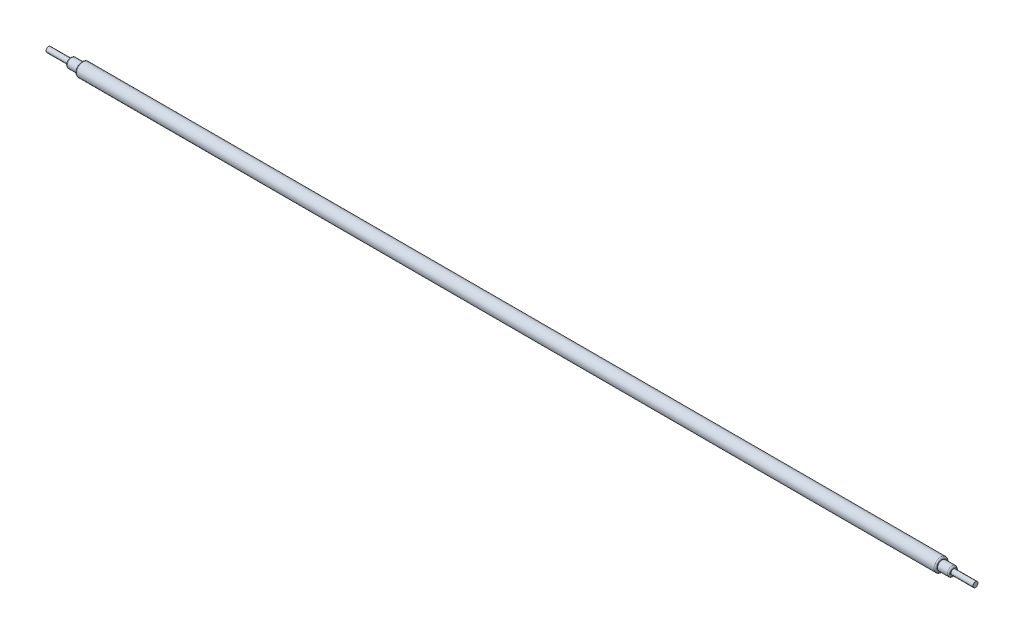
ISO-10303-21;
HEADER;
FILE_DESCRIPTION(('STEP AP214'),'2;1');
FILE_NAME('part.step','',(''),(''),'','','');
FILE_SCHEMA(('AUTOMOTIVE_DESIGN { 1 0 10303 214 1 1 1 1 }'));
ENDSEC;
DATA;
#1=APPLICATION_CONTEXT('core data for automotive mechanical design processes');
#2=APPLICATION_PROTOCOL_DEFINITION('international standard','automotive_design',2000,#1);
#3=PRODUCT_CONTEXT('',#1,'mechanical');
#4=PRODUCT('Part','Part','',(#3));
#5=PRODUCT_RELATED_PRODUCT_CATEGORY('part','',(#4));
#6=PRODUCT_DEFINITION_FORMATION('','',#4);
#7=PRODUCT_DEFINITION_CONTEXT('part definition',#1,'design');
#8=PRODUCT_DEFINITION('design','',#6,#7);
#9=PRODUCT_DEFINITION_SHAPE('','',#8);
#10=(LENGTH_UNIT() NAMED_UNIT(*) SI_UNIT(.MILLI.,.METRE.));
#11=(NAMED_UNIT(*) PLANE_ANGLE_UNIT() SI_UNIT($,.RADIAN.));
#12=(NAMED_UNIT(*) SI_UNIT($,.STERADIAN.) SOLID_ANGLE_UNIT());
#13=UNCERTAINTY_MEASURE_WITH_UNIT(LENGTH_MEASURE(1.E-05),#10,'distance_accuracy_value','');
#14=(GEOMETRIC_REPRESENTATION_CONTEXT(3) GLOBAL_UNCERTAINTY_ASSIGNED_CONTEXT((#13)) GLOBAL_UNIT_ASSIGNED_CONTEXT((#10,
#11,#12)) REPRESENTATION_CONTEXT('',''));
#15=CARTESIAN_POINT('',(0.,0.,0.));
#16=DIRECTION('',(0.,0.,1.));
#17=DIRECTION('',(1.,0.,0.));
#18=AXIS2_PLACEMENT_3D('',#15,#16,#17);
#19=CARTESIAN_POINT('',(347.,0.,0.));
#20=DIRECTION('',(-1.,0.,0.));
#21=DIRECTION('',(0.,0.,1.));
#22=AXIS2_PLACEMENT_3D('',#19,#20,#21);
#23=PLANE('',#22);
#24=CARTESIAN_POINT('',(347.,0.,0.));
#25=DIRECTION('',(-1.,0.,0.));
#26=DIRECTION('',(0.,0.,1.));
#27=AXIS2_PLACEMENT_3D('',#24,#25,#26);
#28=CIRCLE('',#27,1.9);
#29=CARTESIAN_POINT('',(347.,0.,1.9));
#30=VERTEX_POINT('',#29);
#31=EDGE_CURVE('E10',#30,#30,#28,.T.);
#32=ORIENTED_EDGE('',*,*,#31,.F.);
#33=EDGE_LOOP('',(#32));
#34=FACE_BOUND('',#33,.T.);
#35=ADVANCED_FACE('F34',(#34),#23,.F.);
#36=CARTESIAN_POINT('',(-347.,0.,0.));
#37=DIRECTION('',(-1.,0.,0.));
#38=DIRECTION('',(0.,0.,1.));
#39=AXIS2_PLACEMENT_3D('',#36,#37,#38);
#40=CYLINDRICAL_SURFACE('',#39,1.9);
#41=CARTESIAN_POINT('',(330.5,0.,0.));
#42=DIRECTION('',(-1.,0.,0.));
#43=DIRECTION('',(0.,0.,1.));
#44=AXIS2_PLACEMENT_3D('',#41,#42,#43);
#45=CIRCLE('',#44,1.9);
#46=CARTESIAN_POINT('',(330.5,0.,1.9));
#47=VERTEX_POINT('',#46);
#48=EDGE_CURVE('E41',#47,#47,#45,.T.);
#49=ORIENTED_EDGE('',*,*,#48,.F.);
#50=EDGE_LOOP('',(#49));
#51=FACE_BOUND('',#50,.T.);
#52=ORIENTED_EDGE('',*,*,#31,.T.);
#53=EDGE_LOOP('',(#52));
#54=FACE_BOUND('',#53,.T.);
#55=ADVANCED_FACE('F168',(#51,#54),#40,.T.);
#56=CARTESIAN_POINT('',(330.5,1.9,0.));
#57=DIRECTION('',(-1.,0.,0.));
#58=DIRECTION('',(0.,0.,1.));
#59=AXIS2_PLACEMENT_3D('',#56,#57,#58);
#60=PLANE('',#59);
#61=CARTESIAN_POINT('',(330.5,0.,0.));
#62=DIRECTION('',(-1.,0.,0.));
#63=DIRECTION('',(0.,0.,1.));
#64=AXIS2_PLACEMENT_3D('',#61,#62,#63);
#65=CIRCLE('',#64,2.5);
#66=CARTESIAN_POINT('',(330.5,0.,2.5));
#67=VERTEX_POINT('',#66);
#68=EDGE_CURVE('E47',#67,#67,#65,.T.);
#69=ORIENTED_EDGE('',*,*,#68,.F.);
#70=EDGE_LOOP('',(#69));
#71=FACE_BOUND('',#70,.T.);
#72=ORIENTED_EDGE('',*,*,#48,.T.);
#73=EDGE_LOOP('',(#72));
#74=FACE_BOUND('',#73,.T.);
#75=ADVANCED_FACE('F163',(#71,#74),#60,.F.);
#76=CARTESIAN_POINT('',(329.5,0.,0.));
#77=DIRECTION('',(-1.,0.,0.));
#78=DIRECTION('',(0.,0.,1.));
#79=AXIS2_PLACEMENT_3D('',#76,#77,#78);
#80=TOROIDAL_SURFACE('',#79,2.5,1.);
#81=CARTESIAN_POINT('',(329.5,0.,0.));
#82=DIRECTION('',(-1.,0.,0.));
#83=DIRECTION('',(0.,0.,1.));
#84=AXIS2_PLACEMENT_3D('',#81,#82,#83);
#85=CIRCLE('',#84,3.5);
#86=CARTESIAN_POINT('',(329.5,0.,3.5));
#87=VERTEX_POINT('',#86);
#88=EDGE_CURVE('E54',#87,#87,#85,.T.);
#89=ORIENTED_EDGE('',*,*,#88,.F.);
#90=EDGE_LOOP('',(#89));
#91=FACE_BOUND('',#90,.T.);
#92=ORIENTED_EDGE('',*,*,#68,.T.);
#93=EDGE_LOOP('',(#92));
#94=FACE_BOUND('',#93,.T.);
#95=ADVANCED_FACE('F157',(#91,#94),#80,.T.);
#96=CARTESIAN_POINT('',(-347.,0.,0.));
#97=DIRECTION('',(-1.,0.,0.));
#98=DIRECTION('',(0.,0.,1.));
#99=AXIS2_PLACEMENT_3D('',#96,#97,#98);
#100=CYLINDRICAL_SURFACE('',#99,3.5);
#101=CARTESIAN_POINT('',(322.,0.,0.));
#102=DIRECTION('',(-1.,0.,0.));
#103=DIRECTION('',(0.,0.,1.));
#104=AXIS2_PLACEMENT_3D('',#101,#102,#103);
#105=CIRCLE('',#104,3.5);
#106=CARTESIAN_POINT('',(322.,0.,3.5));
#107=VERTEX_POINT('',#106);
#108=EDGE_CURVE('E59',#107,#107,#105,.T.);
#109=ORIENTED_EDGE('',*,*,#108,.F.);
#110=EDGE_LOOP('',(#109));
#111=FACE_BOUND('',#110,.T.);
#112=ORIENTED_EDGE('',*,*,#88,.T.);
#113=EDGE_LOOP('',(#112));
#114=FACE_BOUND('',#113,.T.);
#115=ADVANCED_FACE('F151',(#111,#114),#100,.T.);
#116=CARTESIAN_POINT('',(322.,3.5,0.));
#117=DIRECTION('',(-1.,0.,0.));
#118=DIRECTION('',(0.,0.,1.));
#119=AXIS2_PLACEMENT_3D('',#116,#117,#118);
#120=PLANE('',#119);
#121=CARTESIAN_POINT('',(322.,0.,0.));
#122=DIRECTION('',(-1.,0.,0.));
#123=DIRECTION('',(0.,0.,1.));
#124=AXIS2_PLACEMENT_3D('',#121,#122,#123);
#125=CIRCLE('',#124,4.);
#126=CARTESIAN_POINT('',(322.,0.,4.));
#127=VERTEX_POINT('',#126);
#128=EDGE_CURVE('E62',#127,#127,#125,.T.);
#129=ORIENTED_EDGE('',*,*,#128,.F.);
#130=EDGE_LOOP('',(#129));
#131=FACE_BOUND('',#130,.T.);
#132=ORIENTED_EDGE('',*,*,#108,.T.);
#133=EDGE_LOOP('',(#132));
#134=FACE_BOUND('',#133,.T.);
#135=ADVANCED_FACE('F145',(#131,#134),#120,.F.);
#136=CARTESIAN_POINT('',(321.,0.,0.));
#137=DIRECTION('',(-1.,0.,0.));
#138=DIRECTION('',(0.,0.,1.));
#139=AXIS2_PLACEMENT_3D('',#136,#137,#138);
#140=TOROIDAL_SURFACE('',#139,4.,1.);
#141=CARTESIAN_POINT('',(321.,0.,0.));
#142=DIRECTION('',(-1.,0.,0.));
#143=DIRECTION('',(0.,0.,1.));
#144=AXIS2_PLACEMENT_3D('',#141,#142,#143);
#145=CIRCLE('',#144,5.);
#146=CARTESIAN_POINT('',(321.,0.,5.));
#147=VERTEX_POINT('',#146);
#148=EDGE_CURVE('E66',#147,#147,#145,.T.);
#149=ORIENTED_EDGE('',*,*,#148,.F.);
#150=EDGE_LOOP('',(#149));
#151=FACE_BOUND('',#150,.T.);
#152=ORIENTED_EDGE('',*,*,#128,.T.);
#153=EDGE_LOOP('',(#152));
#154=FACE_BOUND('',#153,.T.);
#155=ADVANCED_FACE('F139',(#151,#154),#140,.T.);
#156=CARTESIAN_POINT('',(-347.,0.,0.));
#157=DIRECTION('',(-1.,0.,0.));
#158=DIRECTION('',(0.,0.,1.));
#159=AXIS2_PLACEMENT_3D('',#156,#157,#158);
#160=CYLINDRICAL_SURFACE('',#159,5.);
#161=CARTESIAN_POINT('',(-321.,0.,0.));
#162=DIRECTION('',(-1.,0.,0.));
#163=DIRECTION('',(0.,0.,1.));
#164=AXIS2_PLACEMENT_3D('',#161,#162,#163);
#165=CIRCLE('',#164,5.);
#166=CARTESIAN_POINT('',(-321.,0.,5.));
#167=VERTEX_POINT('',#166);
#168=EDGE_CURVE('E70',#167,#167,#165,.T.);
#169=ORIENTED_EDGE('',*,*,#168,.F.);
#170=EDGE_LOOP('',(#169));
#171=FACE_BOUND('',#170,.T.);
#172=ORIENTED_EDGE('',*,*,#148,.T.);
#173=EDGE_LOOP('',(#172));
#174=FACE_BOUND('',#173,.T.);
#175=ADVANCED_FACE('F133',(#171,#174),#160,.T.);
#176=CARTESIAN_POINT('',(-321.,0.,0.));
#177=DIRECTION('',(-1.,0.,0.));
#178=DIRECTION('',(0.,0.,1.));
#179=AXIS2_PLACEMENT_3D('',#176,#177,#178);
#180=TOROIDAL_SURFACE('',#179,4.,1.);
#181=CARTESIAN_POINT('',(-322.,0.,0.));
#182=DIRECTION('',(-1.,0.,0.));
#183=DIRECTION('',(0.,0.,1.));
#184=AXIS2_PLACEMENT_3D('',#181,#182,#183);
#185=CIRCLE('',#184,4.);
#186=CARTESIAN_POINT('',(-322.,0.,4.));
#187=VERTEX_POINT('',#186);
#188=EDGE_CURVE('E74',#187,#187,#185,.T.);
#189=ORIENTED_EDGE('',*,*,#188,.F.);
#190=EDGE_LOOP('',(#189));
#191=FACE_BOUND('',#190,.T.);
#192=ORIENTED_EDGE('',*,*,#168,.T.);
#193=EDGE_LOOP('',(#192));
#194=FACE_BOUND('',#193,.T.);
#195=ADVANCED_FACE('F127',(#191,#194),#180,.T.);
#196=CARTESIAN_POINT('',(-322.,3.5,0.));
#197=DIRECTION('',(1.,0.,0.));
#198=DIRECTION('',(0.,0.,-1.));
#199=AXIS2_PLACEMENT_3D('',#196,#197,#198);
#200=PLANE('',#199);
#201=CARTESIAN_POINT('',(-322.,0.,0.));
#202=DIRECTION('',(-1.,0.,0.));
#203=DIRECTION('',(0.,0.,1.));
#204=AXIS2_PLACEMENT_3D('',#201,#202,#203);
#205=CIRCLE('',#204,3.5);
#206=CARTESIAN_POINT('',(-322.,0.,3.5));
#207=VERTEX_POINT('',#206);
#208=EDGE_CURVE('E78',#207,#207,#205,.T.);
#209=ORIENTED_EDGE('',*,*,#208,.F.);
#210=EDGE_LOOP('',(#209));
#211=FACE_BOUND('',#210,.T.);
#212=ORIENTED_EDGE('',*,*,#188,.T.);
#213=EDGE_LOOP('',(#212));
#214=FACE_BOUND('',#213,.T.);
#215=ADVANCED_FACE('F121',(#211,#214),#200,.F.);
#216=CARTESIAN_POINT('',(-347.,0.,0.));
#217=DIRECTION('',(-1.,0.,0.));
#218=DIRECTION('',(0.,0.,1.));
#219=AXIS2_PLACEMENT_3D('',#216,#217,#218);
#220=CYLINDRICAL_SURFACE('',#219,3.5);
#221=CARTESIAN_POINT('',(-329.5,0.,0.));
#222=DIRECTION('',(-1.,0.,0.));
#223=DIRECTION('',(0.,0.,1.));
#224=AXIS2_PLACEMENT_3D('',#221,#222,#223);
#225=CIRCLE('',#224,3.5);
#226=CARTESIAN_POINT('',(-329.5,0.,3.5));
#227=VERTEX_POINT('',#226);
#228=EDGE_CURVE('E82',#227,#227,#225,.T.);
#229=ORIENTED_EDGE('',*,*,#228,.F.);
#230=EDGE_LOOP('',(#229));
#231=FACE_BOUND('',#230,.T.);
#232=ORIENTED_EDGE('',*,*,#208,.T.);
#233=EDGE_LOOP('',(#232));
#234=FACE_BOUND('',#233,.T.);
#235=ADVANCED_FACE('F115',(#231,#234),#220,.T.);
#236=CARTESIAN_POINT('',(-329.5,0.,0.));
#237=DIRECTION('',(-1.,0.,0.));
#238=DIRECTION('',(0.,0.,1.));
#239=AXIS2_PLACEMENT_3D('',#236,#237,#238);
#240=TOROIDAL_SURFACE('',#239,2.5,1.);
#241=CARTESIAN_POINT('',(-330.5,0.,0.));
#242=DIRECTION('',(-1.,0.,0.));
#243=DIRECTION('',(0.,0.,1.));
#244=AXIS2_PLACEMENT_3D('',#241,#242,#243);
#245=CIRCLE('',#244,2.5);
#246=CARTESIAN_POINT('',(-330.5,0.,2.5));
#247=VERTEX_POINT('',#246);
#248=EDGE_CURVE('E86',#247,#247,#245,.T.);
#249=ORIENTED_EDGE('',*,*,#248,.F.);
#250=EDGE_LOOP('',(#249));
#251=FACE_BOUND('',#250,.T.);
#252=ORIENTED_EDGE('',*,*,#228,.T.);
#253=EDGE_LOOP('',(#252));
#254=FACE_BOUND('',#253,.T.);
#255=ADVANCED_FACE('F109',(#251,#254),#240,.T.);
#256=CARTESIAN_POINT('',(-330.5,1.9,0.));
#257=DIRECTION('',(1.,0.,0.));
#258=DIRECTION('',(0.,0.,-1.));
#259=AXIS2_PLACEMENT_3D('',#256,#257,#258);
#260=PLANE('',#259);
#261=CARTESIAN_POINT('',(-330.5,0.,0.));
#262=DIRECTION('',(-1.,0.,0.));
#263=DIRECTION('',(0.,0.,1.));
#264=AXIS2_PLACEMENT_3D('',#261,#262,#263);
#265=CIRCLE('',#264,1.9);
#266=CARTESIAN_POINT('',(-330.5,0.,1.9));
#267=VERTEX_POINT('',#266);
#268=EDGE_CURVE('E90',#267,#267,#265,.T.);
#269=ORIENTED_EDGE('',*,*,#268,.F.);
#270=EDGE_LOOP('',(#269));
#271=FACE_BOUND('',#270,.T.);
#272=ORIENTED_EDGE('',*,*,#248,.T.);
#273=EDGE_LOOP('',(#272));
#274=FACE_BOUND('',#273,.T.);
#275=ADVANCED_FACE('F103',(#271,#274),#260,.F.);
#276=CARTESIAN_POINT('',(-347.,0.,0.));
#277=DIRECTION('',(-1.,0.,0.));
#278=DIRECTION('',(0.,0.,1.));
#279=AXIS2_PLACEMENT_3D('',#276,#277,#278);
#280=CYLINDRICAL_SURFACE('',#279,1.9);
#281=CARTESIAN_POINT('',(-347.,0.,0.));
#282=DIRECTION('',(-1.,0.,0.));
#283=DIRECTION('',(0.,0.,1.));
#284=AXIS2_PLACEMENT_3D('',#281,#282,#283);
#285=CIRCLE('',#284,1.9);
#286=CARTESIAN_POINT('',(-347.,0.,1.9));
#287=VERTEX_POINT('',#286);
#288=EDGE_CURVE('E94',#287,#287,#285,.T.);
#289=ORIENTED_EDGE('',*,*,#288,.F.);
#290=EDGE_LOOP('',(#289));
#291=FACE_BOUND('',#290,.T.);
#292=ORIENTED_EDGE('',*,*,#268,.T.);
#293=EDGE_LOOP('',(#292));
#294=FACE_BOUND('',#293,.T.);
#295=ADVANCED_FACE('F100',(#291,#294),#280,.T.);
#296=CARTESIAN_POINT('',(-347.,0.,0.));
#297=DIRECTION('',(1.,0.,0.));
#298=DIRECTION('',(0.,0.,-1.));
#299=AXIS2_PLACEMENT_3D('',#296,#297,#298);
#300=PLANE('',#299);
#301=ORIENTED_EDGE('',*,*,#288,.T.);
#302=EDGE_LOOP('',(#301));
#303=FACE_BOUND('',#302,.T.);
#304=ADVANCED_FACE('F98',(#303),#300,.F.);
#305=CLOSED_SHELL('',(#35,#55,#75,#95,#115,#135,#155,#175,#195,#215,#235,#255,#275,#295,#304));
#306=MANIFOLD_SOLID_BREP('B2',#305);
#307=ADVANCED_BREP_SHAPE_REPRESENTATION('',(#18,#306),#14);
#308=SHAPE_DEFINITION_REPRESENTATION(#9,#307);
ENDSEC;
END-ISO-10303-21;
